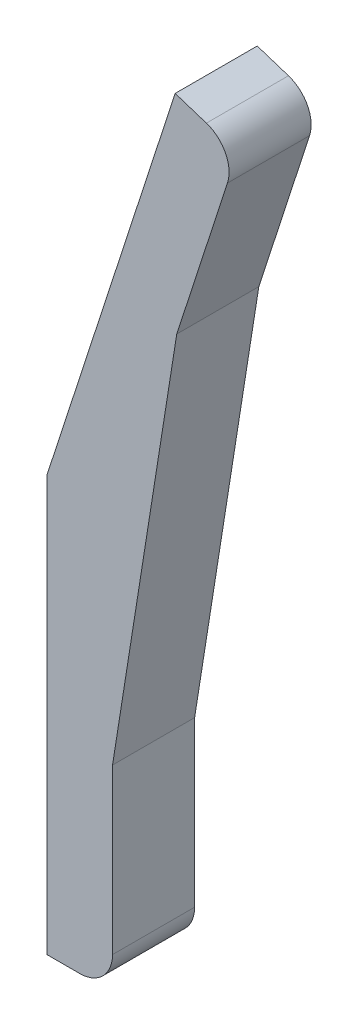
ISO-10303-21;
HEADER;
FILE_DESCRIPTION(('STEP AP214'),'2;1');
FILE_NAME('part.step','',(''),(''),'','','');
FILE_SCHEMA(('AUTOMOTIVE_DESIGN { 1 0 10303 214 1 1 1 1 }'));
ENDSEC;
DATA;
#1=APPLICATION_CONTEXT('core data for automotive mechanical design processes');
#2=APPLICATION_PROTOCOL_DEFINITION('international standard','automotive_design',2000,#1);
#3=PRODUCT_CONTEXT('',#1,'mechanical');
#4=PRODUCT('Part','Part','',(#3));
#5=PRODUCT_RELATED_PRODUCT_CATEGORY('part','',(#4));
#6=PRODUCT_DEFINITION_FORMATION('','',#4);
#7=PRODUCT_DEFINITION_CONTEXT('part definition',#1,'design');
#8=PRODUCT_DEFINITION('design','',#6,#7);
#9=PRODUCT_DEFINITION_SHAPE('','',#8);
#10=(LENGTH_UNIT() NAMED_UNIT(*) SI_UNIT(.MILLI.,.METRE.));
#11=(NAMED_UNIT(*) PLANE_ANGLE_UNIT() SI_UNIT($,.RADIAN.));
#12=(NAMED_UNIT(*) SI_UNIT($,.STERADIAN.) SOLID_ANGLE_UNIT());
#13=UNCERTAINTY_MEASURE_WITH_UNIT(LENGTH_MEASURE(1.E-05),#10,'distance_accuracy_value','');
#14=(GEOMETRIC_REPRESENTATION_CONTEXT(3) GLOBAL_UNCERTAINTY_ASSIGNED_CONTEXT((#13)) GLOBAL_UNIT_ASSIGNED_CONTEXT((#10,
#11,#12)) REPRESENTATION_CONTEXT('',''));
#15=CARTESIAN_POINT('',(0.,0.,0.));
#16=DIRECTION('',(0.,0.,1.));
#17=DIRECTION('',(1.,0.,0.));
#18=AXIS2_PLACEMENT_3D('',#15,#16,#17);
#19=CARTESIAN_POINT('',(9.92484615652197,30.5455356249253,-6.35));
#20=DIRECTION('',(-0.951056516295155,0.309016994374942,0.));
#21=DIRECTION('',(-0.309016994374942,-0.951056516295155,0.));
#22=AXIS2_PLACEMENT_3D('',#19,#20,#21);
#23=PLANE('',#22);
#24=DIRECTION('',(-0.309016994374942,-0.951056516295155,0.));
#25=VECTOR('',#24,1.);
#26=CARTESIAN_POINT('',(9.92484615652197,30.5455356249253,0.));
#27=LINE('',#26,#25);
#28=CARTESIAN_POINT('',(9.92484615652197,30.5455356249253,0.));
#29=VERTEX_POINT('',#28);
#30=CARTESIAN_POINT('',(0.,0.,0.));
#31=VERTEX_POINT('',#30);
#32=EDGE_CURVE('E141',#29,#31,#27,.T.);
#33=ORIENTED_EDGE('',*,*,#32,.F.);
#34=DIRECTION('',(0.,0.,1.));
#35=VECTOR('',#34,1.);
#36=CARTESIAN_POINT('',(9.92484615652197,30.5455356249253,-6.35));
#37=LINE('',#36,#35);
#38=CARTESIAN_POINT('',(9.92484615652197,30.5455356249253,-6.35));
#39=VERTEX_POINT('',#38);
#40=EDGE_CURVE('E125',#39,#29,#37,.T.);
#41=ORIENTED_EDGE('',*,*,#40,.F.);
#42=DIRECTION('',(-0.309016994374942,-0.951056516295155,0.));
#43=VECTOR('',#42,1.);
#44=CARTESIAN_POINT('',(9.92484615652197,30.5455356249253,-6.35));
#45=LINE('',#44,#43);
#46=CARTESIAN_POINT('',(0.,0.,-6.35));
#47=VERTEX_POINT('',#46);
#48=EDGE_CURVE('E120',#39,#47,#45,.T.);
#49=ORIENTED_EDGE('',*,*,#48,.T.);
#50=DIRECTION('',(0.,0.,1.));
#51=VECTOR('',#50,1.);
#52=CARTESIAN_POINT('',(0.,0.,-6.35));
#53=LINE('',#52,#51);
#54=EDGE_CURVE('E104',#47,#31,#53,.T.);
#55=ORIENTED_EDGE('',*,*,#54,.T.);
#56=EDGE_LOOP('',(#33,#41,#49,#55));
#57=FACE_BOUND('',#56,.T.);
#58=ADVANCED_FACE('F33',(#57),#23,.T.);
#59=CARTESIAN_POINT('',(9.92484615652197,30.5455356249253,-6.35));
#60=DIRECTION('',(0.309016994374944,0.951056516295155,0.));
#61=DIRECTION('',(-0.951056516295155,0.309016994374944,0.));
#62=AXIS2_PLACEMENT_3D('',#59,#60,#61);
#63=PLANE('',#62);
#64=DIRECTION('',(-0.951056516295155,0.309016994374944,0.));
#65=VECTOR('',#64,1.);
#66=CARTESIAN_POINT('',(9.92484615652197,30.5455356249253,0.));
#67=LINE('',#66,#65);
#68=CARTESIAN_POINT('',(12.3405297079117,29.760632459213,0.));
#69=VERTEX_POINT('',#68);
#70=EDGE_CURVE('E126',#69,#29,#67,.T.);
#71=ORIENTED_EDGE('',*,*,#70,.F.);
#72=DIRECTION('',(0.,0.,1.));
#73=VECTOR('',#72,1.);
#74=CARTESIAN_POINT('',(12.3405297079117,29.760632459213,-6.35));
#75=LINE('',#74,#73);
#76=CARTESIAN_POINT('',(12.3405297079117,29.760632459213,-6.35));
#77=VERTEX_POINT('',#76);
#78=EDGE_CURVE('E168',#69,#77,#75,.F.);
#79=ORIENTED_EDGE('',*,*,#78,.T.);
#80=DIRECTION('',(-0.951056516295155,0.309016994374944,0.));
#81=VECTOR('',#80,1.);
#82=CARTESIAN_POINT('',(9.92484615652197,30.5455356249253,-6.35));
#83=LINE('',#82,#81);
#84=EDGE_CURVE('E115',#77,#39,#83,.T.);
#85=ORIENTED_EDGE('',*,*,#84,.T.);
#86=ORIENTED_EDGE('',*,*,#40,.T.);
#87=EDGE_LOOP('',(#71,#79,#85,#86));
#88=FACE_BOUND('',#87,.T.);
#89=ADVANCED_FACE('F183',(#88),#63,.T.);
#90=CARTESIAN_POINT('',(14.7562132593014,28.9757292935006,-6.35));
#91=DIRECTION('',(0.951056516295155,-0.309016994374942,0.));
#92=DIRECTION('',(0.309016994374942,0.951056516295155,0.));
#93=AXIS2_PLACEMENT_3D('',#90,#91,#92);
#94=PLANE('',#93);
#95=DIRECTION('',(0.309016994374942,0.951056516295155,0.));
#96=VECTOR('',#95,1.);
#97=CARTESIAN_POINT('',(14.7562132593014,28.9757292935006,-6.35));
#98=LINE('',#97,#96);
#99=CARTESIAN_POINT('',(10.0467942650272,14.4816279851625,-6.35));
#100=VERTEX_POINT('',#99);
#101=CARTESIAN_POINT('',(13.971310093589,26.5600457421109,-6.35));
#102=VERTEX_POINT('',#101);
#103=EDGE_CURVE('E137',#100,#102,#98,.T.);
#104=ORIENTED_EDGE('',*,*,#103,.T.);
#105=DIRECTION('',(0.,0.,1.));
#106=VECTOR('',#105,1.);
#107=CARTESIAN_POINT('',(13.971310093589,26.5600457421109,-6.35));
#108=LINE('',#107,#106);
#109=CARTESIAN_POINT('',(13.971310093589,26.5600457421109,0.));
#110=VERTEX_POINT('',#109);
#111=EDGE_CURVE('E155',#102,#110,#108,.T.);
#112=ORIENTED_EDGE('',*,*,#111,.T.);
#113=DIRECTION('',(0.309016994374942,0.951056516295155,0.));
#114=VECTOR('',#113,1.);
#115=CARTESIAN_POINT('',(14.7562132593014,28.9757292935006,0.));
#116=LINE('',#115,#114);
#117=CARTESIAN_POINT('',(10.0467942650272,14.4816279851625,0.));
#118=VERTEX_POINT('',#117);
#119=EDGE_CURVE('E128',#118,#110,#116,.T.);
#120=ORIENTED_EDGE('',*,*,#119,.F.);
#121=DIRECTION('',(0.,0.,1.));
#122=VECTOR('',#121,1.);
#123=CARTESIAN_POINT('',(10.0467942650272,14.4816279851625,-6.35));
#124=LINE('',#123,#122);
#125=EDGE_CURVE('E156',#100,#118,#124,.T.);
#126=ORIENTED_EDGE('',*,*,#125,.F.);
#127=EDGE_LOOP('',(#104,#112,#120,#126));
#128=FACE_BOUND('',#127,.T.);
#129=ADVANCED_FACE('F191',(#128),#94,.T.);
#130=CARTESIAN_POINT('',(5.08,-16.8774768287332,-6.35));
#131=DIRECTION('',(0.987688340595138,-0.156434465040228,0.));
#132=DIRECTION('',(0.156434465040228,0.987688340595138,0.));
#133=AXIS2_PLACEMENT_3D('',#130,#131,#132);
#134=PLANE('',#133);
#135=DIRECTION('',(0.156434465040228,0.987688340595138,0.));
#136=VECTOR('',#135,1.);
#137=CARTESIAN_POINT('',(5.08,-16.8774768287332,0.));
#138=LINE('',#137,#136);
#139=CARTESIAN_POINT('',(5.08,-16.8774768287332,0.));
#140=VERTEX_POINT('',#139);
#141=EDGE_CURVE('E149',#140,#118,#138,.T.);
#142=ORIENTED_EDGE('',*,*,#141,.F.);
#143=DIRECTION('',(0.,0.,1.));
#144=VECTOR('',#143,1.);
#145=CARTESIAN_POINT('',(5.08,-16.8774768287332,-6.35));
#146=LINE('',#145,#144);
#147=CARTESIAN_POINT('',(5.08,-16.8774768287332,-6.35));
#148=VERTEX_POINT('',#147);
#149=EDGE_CURVE('E158',#148,#140,#146,.T.);
#150=ORIENTED_EDGE('',*,*,#149,.F.);
#151=DIRECTION('',(0.156434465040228,0.987688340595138,0.));
#152=VECTOR('',#151,1.);
#153=CARTESIAN_POINT('',(5.08,-16.8774768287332,-6.35));
#154=LINE('',#153,#152);
#155=EDGE_CURVE('E134',#148,#100,#154,.T.);
#156=ORIENTED_EDGE('',*,*,#155,.T.);
#157=ORIENTED_EDGE('',*,*,#125,.T.);
#158=EDGE_LOOP('',(#142,#150,#156,#157));
#159=FACE_BOUND('',#158,.T.);
#160=ADVANCED_FACE('F195',(#159),#134,.T.);
#161=CARTESIAN_POINT('',(5.08,-32.1174768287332,-6.35));
#162=DIRECTION('',(1.,0.,0.));
#163=DIRECTION('',(0.,1.,0.));
#164=AXIS2_PLACEMENT_3D('',#161,#162,#163);
#165=PLANE('',#164);
#166=DIRECTION('',(0.,1.,0.));
#167=VECTOR('',#166,1.);
#168=CARTESIAN_POINT('',(5.08,-32.1174768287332,0.));
#169=LINE('',#168,#167);
#170=CARTESIAN_POINT('',(5.08,-29.5774768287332,0.));
#171=VERTEX_POINT('',#170);
#172=EDGE_CURVE('E147',#171,#140,#169,.T.);
#173=ORIENTED_EDGE('',*,*,#172,.F.);
#174=DIRECTION('',(0.,0.,1.));
#175=VECTOR('',#174,1.);
#176=CARTESIAN_POINT('',(5.08,-29.5774768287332,-6.35));
#177=LINE('',#176,#175);
#178=CARTESIAN_POINT('',(5.08,-29.5774768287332,-6.35));
#179=VERTEX_POINT('',#178);
#180=EDGE_CURVE('E11',#171,#179,#177,.F.);
#181=ORIENTED_EDGE('',*,*,#180,.T.);
#182=DIRECTION('',(0.,1.,0.));
#183=VECTOR('',#182,1.);
#184=CARTESIAN_POINT('',(5.08,-32.1174768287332,-6.35));
#185=LINE('',#184,#183);
#186=EDGE_CURVE('E132',#179,#148,#185,.T.);
#187=ORIENTED_EDGE('',*,*,#186,.T.);
#188=ORIENTED_EDGE('',*,*,#149,.T.);
#189=EDGE_LOOP('',(#173,#181,#187,#188));
#190=FACE_BOUND('',#189,.T.);
#191=ADVANCED_FACE('F213',(#190),#165,.T.);
#192=CARTESIAN_POINT('',(0.,-32.1174768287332,-6.35));
#193=DIRECTION('',(0.,-1.,0.));
#194=DIRECTION('',(0.,0.,-1.));
#195=AXIS2_PLACEMENT_3D('',#192,#193,#194);
#196=PLANE('',#195);
#197=DIRECTION('',(1.,0.,0.));
#198=VECTOR('',#197,1.);
#199=CARTESIAN_POINT('',(0.,-32.1174768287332,-6.35));
#200=LINE('',#199,#198);
#201=CARTESIAN_POINT('',(0.,-32.1174768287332,-6.35));
#202=VERTEX_POINT('',#201);
#203=CARTESIAN_POINT('',(2.54,-32.1174768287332,-6.35));
#204=VERTEX_POINT('',#203);
#205=EDGE_CURVE('E121',#202,#204,#200,.T.);
#206=ORIENTED_EDGE('',*,*,#205,.T.);
#207=DIRECTION('',(0.,0.,1.));
#208=VECTOR('',#207,1.);
#209=CARTESIAN_POINT('',(2.54,-32.1174768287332,-6.35));
#210=LINE('',#209,#208);
#211=CARTESIAN_POINT('',(2.54,-32.1174768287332,0.));
#212=VERTEX_POINT('',#211);
#213=EDGE_CURVE('E41',#204,#212,#210,.T.);
#214=ORIENTED_EDGE('',*,*,#213,.T.);
#215=DIRECTION('',(1.,0.,0.));
#216=VECTOR('',#215,1.);
#217=CARTESIAN_POINT('',(0.,-32.1174768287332,0.));
#218=LINE('',#217,#216);
#219=CARTESIAN_POINT('',(0.,-32.1174768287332,0.));
#220=VERTEX_POINT('',#219);
#221=EDGE_CURVE('E144',#220,#212,#218,.T.);
#222=ORIENTED_EDGE('',*,*,#221,.F.);
#223=DIRECTION('',(0.,0.,1.));
#224=VECTOR('',#223,1.);
#225=CARTESIAN_POINT('',(0.,-32.1174768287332,-6.35));
#226=LINE('',#225,#224);
#227=EDGE_CURVE('E114',#202,#220,#226,.T.);
#228=ORIENTED_EDGE('',*,*,#227,.F.);
#229=EDGE_LOOP('',(#206,#214,#222,#228));
#230=FACE_BOUND('',#229,.T.);
#231=ADVANCED_FACE('F176',(#230),#196,.T.);
#232=CARTESIAN_POINT('',(0.,0.,-6.35));
#233=DIRECTION('',(-1.,0.,0.));
#234=DIRECTION('',(0.,-1.,0.));
#235=AXIS2_PLACEMENT_3D('',#232,#233,#234);
#236=PLANE('',#235);
#237=DIRECTION('',(0.,-1.,0.));
#238=VECTOR('',#237,1.);
#239=CARTESIAN_POINT('',(0.,0.,0.));
#240=LINE('',#239,#238);
#241=EDGE_CURVE('E109',#31,#220,#240,.T.);
#242=ORIENTED_EDGE('',*,*,#241,.F.);
#243=ORIENTED_EDGE('',*,*,#54,.F.);
#244=DIRECTION('',(0.,-1.,0.));
#245=VECTOR('',#244,1.);
#246=CARTESIAN_POINT('',(0.,0.,-6.35));
#247=LINE('',#246,#245);
#248=EDGE_CURVE('E107',#47,#202,#247,.T.);
#249=ORIENTED_EDGE('',*,*,#248,.T.);
#250=ORIENTED_EDGE('',*,*,#227,.T.);
#251=EDGE_LOOP('',(#242,#243,#249,#250));
#252=FACE_BOUND('',#251,.T.);
#253=ADVANCED_FACE('F106',(#252),#236,.T.);
#254=CARTESIAN_POINT('',(0.,0.,-6.35));
#255=DIRECTION('',(0.,0.,1.));
#256=DIRECTION('',(1.,0.,0.));
#257=AXIS2_PLACEMENT_3D('',#254,#255,#256);
#258=PLANE('',#257);
#259=ORIENTED_EDGE('',*,*,#84,.F.);
#260=CARTESIAN_POINT('',(11.5556265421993,27.3449489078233,-6.35));
#261=DIRECTION('',(0.,0.,1.));
#262=DIRECTION('',(1.,0.,0.));
#263=AXIS2_PLACEMENT_3D('',#260,#261,#262);
#264=CIRCLE('',#263,2.54);
#265=EDGE_CURVE('E171',#77,#102,#264,.F.);
#266=ORIENTED_EDGE('',*,*,#265,.T.);
#267=ORIENTED_EDGE('',*,*,#103,.F.);
#268=ORIENTED_EDGE('',*,*,#155,.F.);
#269=ORIENTED_EDGE('',*,*,#186,.F.);
#270=CARTESIAN_POINT('',(2.54,-29.5774768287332,-6.35));
#271=DIRECTION('',(0.,0.,1.));
#272=DIRECTION('',(1.,0.,0.));
#273=AXIS2_PLACEMENT_3D('',#270,#271,#272);
#274=CIRCLE('',#273,2.54);
#275=EDGE_CURVE('E48',#179,#204,#274,.F.);
#276=ORIENTED_EDGE('',*,*,#275,.T.);
#277=ORIENTED_EDGE('',*,*,#205,.F.);
#278=ORIENTED_EDGE('',*,*,#248,.F.);
#279=ORIENTED_EDGE('',*,*,#48,.F.);
#280=EDGE_LOOP('',(#259,#266,#267,#268,#269,#276,#277,#278,#279));
#281=FACE_BOUND('',#280,.T.);
#282=ADVANCED_FACE('F119',(#281),#258,.F.);
#283=CARTESIAN_POINT('',(0.,0.,0.));
#284=DIRECTION('',(0.,0.,1.));
#285=DIRECTION('',(1.,0.,0.));
#286=AXIS2_PLACEMENT_3D('',#283,#284,#285);
#287=PLANE('',#286);
#288=ORIENTED_EDGE('',*,*,#119,.T.);
#289=CARTESIAN_POINT('',(11.5556265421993,27.3449489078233,0.));
#290=DIRECTION('',(0.,0.,1.));
#291=DIRECTION('',(1.,0.,0.));
#292=AXIS2_PLACEMENT_3D('',#289,#290,#291);
#293=CIRCLE('',#292,2.54);
#294=EDGE_CURVE('E166',#110,#69,#293,.T.);
#295=ORIENTED_EDGE('',*,*,#294,.T.);
#296=ORIENTED_EDGE('',*,*,#70,.T.);
#297=ORIENTED_EDGE('',*,*,#32,.T.);
#298=ORIENTED_EDGE('',*,*,#241,.T.);
#299=ORIENTED_EDGE('',*,*,#221,.T.);
#300=CARTESIAN_POINT('',(2.54,-29.5774768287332,0.));
#301=DIRECTION('',(0.,0.,1.));
#302=DIRECTION('',(1.,0.,0.));
#303=AXIS2_PLACEMENT_3D('',#300,#301,#302);
#304=CIRCLE('',#303,2.54);
#305=EDGE_CURVE('E164',#212,#171,#304,.T.);
#306=ORIENTED_EDGE('',*,*,#305,.T.);
#307=ORIENTED_EDGE('',*,*,#172,.T.);
#308=ORIENTED_EDGE('',*,*,#141,.T.);
#309=EDGE_LOOP('',(#288,#295,#296,#297,#298,#299,#306,#307,#308));
#310=FACE_BOUND('',#309,.T.);
#311=ADVANCED_FACE('F179',(#310),#287,.T.);
#312=CARTESIAN_POINT('',(11.5556265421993,27.3449489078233,-6.35));
#313=DIRECTION('',(0.,0.,1.));
#314=DIRECTION('',(1.,0.,0.));
#315=AXIS2_PLACEMENT_3D('',#312,#313,#314);
#316=CYLINDRICAL_SURFACE('',#315,2.54);
#317=ORIENTED_EDGE('',*,*,#265,.F.);
#318=ORIENTED_EDGE('',*,*,#78,.F.);
#319=ORIENTED_EDGE('',*,*,#294,.F.);
#320=ORIENTED_EDGE('',*,*,#111,.F.);
#321=EDGE_LOOP('',(#317,#318,#319,#320));
#322=FACE_BOUND('',#321,.T.);
#323=ADVANCED_FACE('F188',(#322),#316,.T.);
#324=CARTESIAN_POINT('',(2.54,-29.5774768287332,-6.35));
#325=DIRECTION('',(0.,0.,1.));
#326=DIRECTION('',(1.,0.,0.));
#327=AXIS2_PLACEMENT_3D('',#324,#325,#326);
#328=CYLINDRICAL_SURFACE('',#327,2.54);
#329=ORIENTED_EDGE('',*,*,#275,.F.);
#330=ORIENTED_EDGE('',*,*,#180,.F.);
#331=ORIENTED_EDGE('',*,*,#305,.F.);
#332=ORIENTED_EDGE('',*,*,#213,.F.);
#333=EDGE_LOOP('',(#329,#330,#331,#332));
#334=FACE_BOUND('',#333,.T.);
#335=ADVANCED_FACE('F35',(#334),#328,.T.);
#336=CLOSED_SHELL('',(#58,#89,#129,#160,#191,#231,#253,#282,#311,#323,#335));
#337=MANIFOLD_SOLID_BREP('B2',#336);
#338=ADVANCED_BREP_SHAPE_REPRESENTATION('',(#18,#337),#14);
#339=SHAPE_DEFINITION_REPRESENTATION(#9,#338);
ENDSEC;
END-ISO-10303-21;
